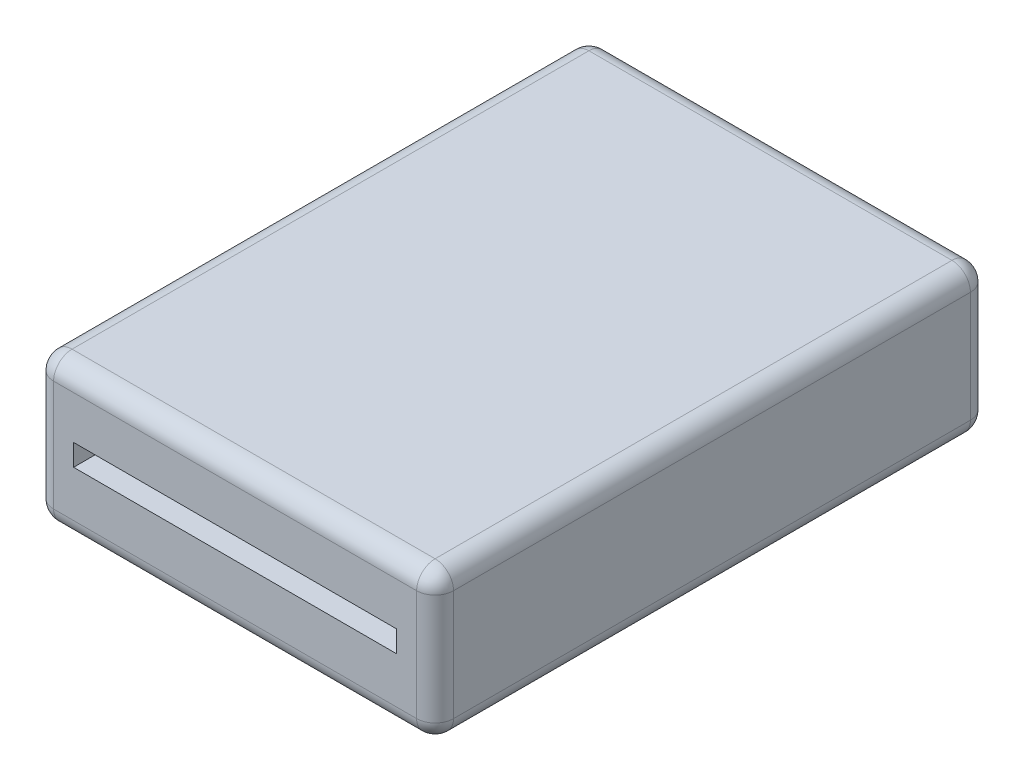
from build123d import *

# Parameters (mm, degrees)
BOSS_EXTRUDE1_DEPTH = 24
FILLET1_R           = 3
SKETCH2_W           = 52.5
SKETCH2_H           = 3.5
CUT_EXTRUDE1_DEPTH  = 40


with BuildPart() as part:
    # Sketch1 → Boss-Extrude1 (new body)
    with BuildSketch(Plane(origin=(0, 0, 0), x_dir=(1, 0, 0), z_dir=(0, 1, 0))):
        with BuildLine():
            Line((-29.5, -45), (29.5, -45))
            ThreePointArc((29.5, -45), (31.621320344, -44.121320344), (32.5, -42))
            Line((32.5, -42), (32.5, 42))
            ThreePointArc((32.5, 42), (31.621320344, 44.121320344), (29.5, 45))
            Line((29.5, 45), (-29.5, 45))
            ThreePointArc((-29.5, 45), (-31.621320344, 44.121320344), (-32.5, 42))
            Line((-32.5, 42), (-32.5, -42))
            ThreePointArc((-32.5, -42), (-31.621320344, -44.121320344), (-29.5, -45))
        make_face()
    extrude(amount=BOSS_EXTRUDE1_DEPTH)

    # Fillet1
    fillet1_edges = [part.edges().sort_by_distance(p)[0] for p in [
        (-32.5, 0, 0),
        (-31.621320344, 0, -44.121320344),
        (0, 0, -45),
        (31.621320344, 0, -44.121320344),
        (-31.621320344, 24, -44.121320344),
        (-32.5, 24, 0),
        (-31.621320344, 24, 44.121320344),
        (0, 24, 45),
        (31.621320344, 24, 44.121320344),
        (32.5, 24, 0),
        (31.621320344, 24, -44.121320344),
        (32.5, 0, 0),
        (0, 24, -45),
        (31.621320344, 0, 44.121320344),
        (0, 0, 45),
        (-31.621320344, 0, 44.121320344),
    ]]
    fillet(fillet1_edges, radius=FILLET1_R)

    # Sketch2 → Cut-Extrude1 (cut)
    with BuildSketch(Plane.XY.offset(45)):
        with Locations((0, 12.248775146)):
            Rectangle(SKETCH2_W, SKETCH2_H)
    extrude(amount=-CUT_EXTRUDE1_DEPTH, mode=Mode.SUBTRACT)


solid = part.part
